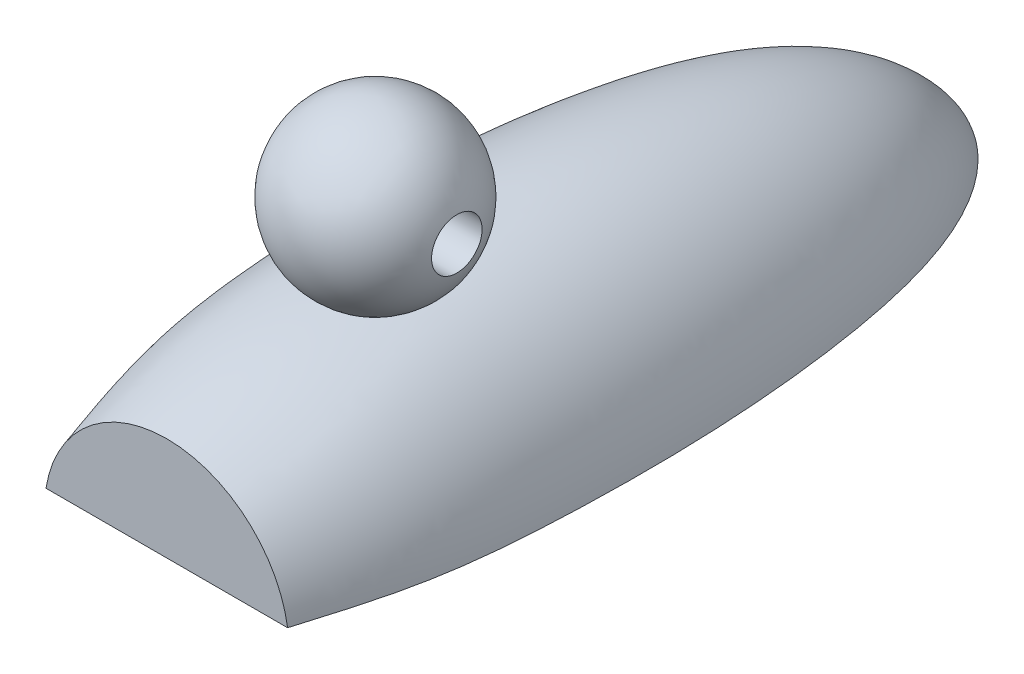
ISO-10303-21;
HEADER;
FILE_DESCRIPTION(('STEP AP214'),'2;1');
FILE_NAME('part.step','',(''),(''),'','','');
FILE_SCHEMA(('AUTOMOTIVE_DESIGN { 1 0 10303 214 1 1 1 1 }'));
ENDSEC;
DATA;
#1=APPLICATION_CONTEXT('core data for automotive mechanical design processes');
#2=APPLICATION_PROTOCOL_DEFINITION('international standard','automotive_design',2000,#1);
#3=PRODUCT_CONTEXT('',#1,'mechanical');
#4=PRODUCT('Part','Part','',(#3));
#5=PRODUCT_RELATED_PRODUCT_CATEGORY('part','',(#4));
#6=PRODUCT_DEFINITION_FORMATION('','',#4);
#7=PRODUCT_DEFINITION_CONTEXT('part definition',#1,'design');
#8=PRODUCT_DEFINITION('design','',#6,#7);
#9=PRODUCT_DEFINITION_SHAPE('','',#8);
#10=(LENGTH_UNIT() NAMED_UNIT(*) SI_UNIT(.MILLI.,.METRE.));
#11=(NAMED_UNIT(*) PLANE_ANGLE_UNIT() SI_UNIT($,.RADIAN.));
#12=(NAMED_UNIT(*) SI_UNIT($,.STERADIAN.) SOLID_ANGLE_UNIT());
#13=UNCERTAINTY_MEASURE_WITH_UNIT(LENGTH_MEASURE(1.E-05),#10,'distance_accuracy_value','');
#14=(GEOMETRIC_REPRESENTATION_CONTEXT(3) GLOBAL_UNCERTAINTY_ASSIGNED_CONTEXT((#13)) GLOBAL_UNIT_ASSIGNED_CONTEXT((#10,
#11,#12)) REPRESENTATION_CONTEXT('',''));
#15=CARTESIAN_POINT('',(0.,0.,0.));
#16=DIRECTION('',(0.,0.,1.));
#17=DIRECTION('',(1.,0.,0.));
#18=AXIS2_PLACEMENT_3D('',#15,#16,#17);
#19=CARTESIAN_POINT('',(0.,0.,0.));
#20=DIRECTION('',(1.,0.,0.));
#21=DIRECTION('',(0.,1.,0.));
#22=AXIS2_PLACEMENT_3D('',#19,#20,#21);
#23=SPHERICAL_SURFACE('',#22,27.);
#24=CARTESIAN_POINT('',(25.7875939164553,0.,0.));
#25=DIRECTION('',(1.,0.,0.));
#26=DIRECTION('',(0.,0.,-1.));
#27=AXIS2_PLACEMENT_3D('',#24,#25,#26);
#28=CIRCLE('',#27,7.99999999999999);
#29=CARTESIAN_POINT('',(25.7875939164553,0.,-7.99999999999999));
#30=VERTEX_POINT('',#29);
#31=EDGE_CURVE('E66',#30,#30,#28,.T.);
#32=ORIENTED_EDGE('',*,*,#31,.F.);
#33=EDGE_LOOP('',(#32));
#34=FACE_BOUND('',#33,.T.);
#35=CARTESIAN_POINT('',(-25.7875939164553,0.,0.));
#36=DIRECTION('',(1.,0.,0.));
#37=DIRECTION('',(0.,0.,-1.));
#38=AXIS2_PLACEMENT_3D('',#35,#36,#37);
#39=CIRCLE('',#38,7.99999999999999);
#40=CARTESIAN_POINT('',(-25.7875939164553,0.,-7.99999999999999));
#41=VERTEX_POINT('',#40);
#42=EDGE_CURVE('E47',#41,#41,#39,.T.);
#43=ORIENTED_EDGE('',*,*,#42,.T.);
#44=EDGE_LOOP('',(#43));
#45=FACE_BOUND('',#44,.T.);
#46=CARTESIAN_POINT('',(0.,-21.9206872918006,15.7633584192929));
#47=CARTESIAN_POINT('',(0.4049198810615,-21.9206851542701,15.7633657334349));
#48=CARTESIAN_POINT('',(0.809773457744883,-21.923426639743,15.7439388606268));
#49=CARTESIAN_POINT('',(1.61587280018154,-21.9342692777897,15.6665490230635));
#50=CARTESIAN_POINT('',(2.01711729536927,-21.9423722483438,15.6085729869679));
#51=CARTESIAN_POINT('',(2.81269208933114,-21.9636047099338,15.4548802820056));
#52=CARTESIAN_POINT('',(3.20701270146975,-21.9767407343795,15.3591145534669));
#53=CARTESIAN_POINT('',(3.98480005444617,-22.007477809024,15.1313158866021));
#54=CARTESIAN_POINT('',(4.36826763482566,-22.0250785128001,14.9992857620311));
#55=CARTESIAN_POINT('',(5.11961105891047,-22.0639285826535,14.7015494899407));
#56=CARTESIAN_POINT('',(5.48755092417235,-22.0851606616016,14.5360022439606));
#57=CARTESIAN_POINT('',(6.20715963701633,-22.1304924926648,14.173051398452));
#58=CARTESIAN_POINT('',(6.55882807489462,-22.1545923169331,13.9756469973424));
#59=CARTESIAN_POINT('',(7.24368372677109,-22.2047419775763,13.5514329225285));
#60=CARTESIAN_POINT('',(7.57687422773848,-22.2307914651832,13.3246285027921));
#61=CARTESIAN_POINT('',(8.22311891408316,-22.2838981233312,12.8441052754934));
#62=CARTESIAN_POINT('',(8.53617325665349,-22.3109552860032,12.5903866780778));
#63=CARTESIAN_POINT('',(9.13346844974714,-22.3644755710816,12.0650333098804));
#64=CARTESIAN_POINT('',(9.41822381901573,-22.3909371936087,11.7939819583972));
#65=CARTESIAN_POINT('',(9.96644842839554,-22.4430804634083,11.2309033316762));
#66=CARTESIAN_POINT('',(10.2299094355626,-22.4687618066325,10.9388680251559));
#67=CARTESIAN_POINT('',(10.7346796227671,-22.518523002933,10.3362397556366));
#68=CARTESIAN_POINT('',(10.9759931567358,-22.542603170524,10.0256504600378));
#69=CARTESIAN_POINT('',(11.4360597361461,-22.5884233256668,9.38801309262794));
#70=CARTESIAN_POINT('',(11.6548104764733,-22.6101630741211,9.06096334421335));
#71=CARTESIAN_POINT('',(12.0987557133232,-22.6534841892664,8.34516852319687));
#72=CARTESIAN_POINT('',(12.3204823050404,-22.6746078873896,7.95424173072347));
#73=CARTESIAN_POINT('',(12.7338070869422,-22.7120235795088,7.1565579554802));
#74=CARTESIAN_POINT('',(12.925403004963,-22.7283152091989,6.74979978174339));
#75=CARTESIAN_POINT('',(13.2784146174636,-22.7553113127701,5.92299235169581));
#76=CARTESIAN_POINT('',(13.4398155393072,-22.7660130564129,5.50293670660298));
#77=CARTESIAN_POINT('',(13.7322976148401,-22.7811902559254,4.65228545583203));
#78=CARTESIAN_POINT('',(13.8633765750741,-22.7856652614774,4.2216890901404));
#79=CARTESIAN_POINT('',(14.1099237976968,-22.7880333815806,3.29733297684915));
#80=CARTESIAN_POINT('',(14.2213136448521,-22.7850213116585,2.80247930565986));
#81=CARTESIAN_POINT('',(14.4057243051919,-22.7699614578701,1.80580053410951));
#82=CARTESIAN_POINT('',(14.4787421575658,-22.757912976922,1.30397489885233));
#83=CARTESIAN_POINT('',(14.5865211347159,-22.724493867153,0.296380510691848));
#84=CARTESIAN_POINT('',(14.6212700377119,-22.7031202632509,-0.209389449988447));
#85=CARTESIAN_POINT('',(14.6525566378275,-22.6509894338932,-1.22162604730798));
#86=CARTESIAN_POINT('',(14.649093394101,-22.6202319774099,-1.72809270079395));
#87=CARTESIAN_POINT('',(14.6023021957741,-22.5468120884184,-2.7769548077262));
#88=CARTESIAN_POINT('',(14.5559771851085,-22.503424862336,-3.31916865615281));
#89=CARTESIAN_POINT('',(14.4192003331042,-22.4064629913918,-4.39711676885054));
#90=CARTESIAN_POINT('',(14.3287456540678,-22.3528876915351,-4.93285061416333));
#91=CARTESIAN_POINT('',(14.1036456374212,-22.2363251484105,-5.9942360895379));
#92=CARTESIAN_POINT('',(13.9689766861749,-22.1733328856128,-6.5198821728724));
#93=CARTESIAN_POINT('',(13.6554655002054,-22.0390912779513,-7.55675604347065));
#94=CARTESIAN_POINT('',(13.4766249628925,-21.9678422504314,-8.06798438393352));
#95=CARTESIAN_POINT('',(13.0760372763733,-21.8190097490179,-9.06875192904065));
#96=CARTESIAN_POINT('',(12.8545584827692,-21.7414675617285,-9.55840440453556));
#97=CARTESIAN_POINT('',(12.3681905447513,-21.5814569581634,-10.5148898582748));
#98=CARTESIAN_POINT('',(12.1032978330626,-21.4989881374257,-10.9817209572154));
#99=CARTESIAN_POINT('',(11.5308094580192,-21.331365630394,-11.8872486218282));
#100=CARTESIAN_POINT('',(11.223269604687,-21.2462155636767,-12.3259808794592));
#101=CARTESIAN_POINT('',(10.7305627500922,-21.1183685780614,-12.9592808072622));
#102=CARTESIAN_POINT('',(10.5611076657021,-21.0757356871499,-13.1662336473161));
#103=CARTESIAN_POINT('',(10.2117936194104,-20.9907479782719,-13.5713340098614));
#104=CARTESIAN_POINT('',(10.0319320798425,-20.9483932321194,-13.7694793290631));
#105=CARTESIAN_POINT('',(9.56985069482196,-20.8433822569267,-14.2525798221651));
#106=CARTESIAN_POINT('',(9.28128145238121,-20.7811253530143,-14.5315986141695));
#107=CARTESIAN_POINT('',(8.68229637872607,-20.6593545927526,-15.0656393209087));
#108=CARTESIAN_POINT('',(8.37188507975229,-20.5998401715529,-15.3206661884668));
#109=CARTESIAN_POINT('',(7.73050622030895,-20.4848744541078,-15.8042308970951));
#110=CARTESIAN_POINT('',(7.39954653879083,-20.429421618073,-16.0327787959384));
#111=CARTESIAN_POINT('',(6.71859146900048,-20.3238798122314,-16.4610144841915));
#112=CARTESIAN_POINT('',(6.36859545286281,-20.273791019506,-16.6607013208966));
#113=CARTESIAN_POINT('',(5.6495237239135,-20.1799926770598,-17.0298938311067));
#114=CARTESIAN_POINT('',(5.28034761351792,-20.1363225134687,-17.1992144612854));
#115=CARTESIAN_POINT('',(4.52739786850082,-20.0569337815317,-17.5039594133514));
#116=CARTESIAN_POINT('',(4.14362409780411,-20.0212152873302,-17.6393834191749));
#117=CARTESIAN_POINT('',(3.36467375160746,-19.958798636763,-17.8743315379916));
#118=CARTESIAN_POINT('',(2.96950185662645,-19.9320968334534,-17.9738701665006));
#119=CARTESIAN_POINT('',(2.17106321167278,-19.8885233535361,-18.1355856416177));
#120=CARTESIAN_POINT('',(1.76779735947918,-19.8716505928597,-18.1977666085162));
#121=CARTESIAN_POINT('',(0.999295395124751,-19.8494895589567,-18.2792950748));
#122=CARTESIAN_POINT('',(0.634486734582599,-19.8431753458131,-18.3024382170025));
#123=CARTESIAN_POINT('',(-0.0958118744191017,-19.8390181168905,-18.3176840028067));
#124=CARTESIAN_POINT('',(-0.461301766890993,-19.8411744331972,-18.3097890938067));
#125=CARTESIAN_POINT('',(-1.19005461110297,-19.853900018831,-18.2630708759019));
#126=CARTESIAN_POINT('',(-1.55331808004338,-19.8644672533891,-18.2242550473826));
#127=CARTESIAN_POINT('',(-2.27495578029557,-19.8937382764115,-18.1162101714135));
#128=CARTESIAN_POINT('',(-2.63333001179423,-19.9124420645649,-18.0469811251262));
#129=CARTESIAN_POINT('',(-3.32918568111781,-19.9566599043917,-17.8821616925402));
#130=CARTESIAN_POINT('',(-3.66694521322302,-19.9818903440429,-17.7876646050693));
#131=CARTESIAN_POINT('',(-4.3333898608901,-20.0388709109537,-17.5723878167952));
#132=CARTESIAN_POINT('',(-4.66207531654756,-20.0706207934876,-17.451609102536));
#133=CARTESIAN_POINT('',(-5.30851399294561,-20.1399532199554,-17.1850345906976));
#134=CARTESIAN_POINT('',(-5.6262663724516,-20.1775362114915,-17.0392368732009));
#135=CARTESIAN_POINT('',(-6.24918418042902,-20.2577573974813,-16.7240672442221));
#136=CARTESIAN_POINT('',(-6.55434903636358,-20.3003958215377,-16.5546942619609));
#137=CARTESIAN_POINT('',(-7.16854011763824,-20.3925736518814,-16.1831277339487));
#138=CARTESIAN_POINT('',(-7.47670611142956,-20.4423732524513,-15.979577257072));
#139=CARTESIAN_POINT('',(-8.07599306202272,-20.5456942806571,-15.5496451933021));
#140=CARTESIAN_POINT('',(-8.36711350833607,-20.5992158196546,-15.3232629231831));
#141=CARTESIAN_POINT('',(-8.93132670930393,-20.7089713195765,-14.849533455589));
#142=CARTESIAN_POINT('',(-9.20441471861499,-20.7652059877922,-14.6021807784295));
#143=CARTESIAN_POINT('',(-9.73169712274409,-20.8793795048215,-14.0884477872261));
#144=CARTESIAN_POINT('',(-9.98588947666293,-20.937318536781,-13.8220654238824));
#145=CARTESIAN_POINT('',(-10.5052302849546,-21.0612072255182,-13.2378679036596));
#146=CARTESIAN_POINT('',(-10.7677997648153,-21.1272557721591,-12.9177792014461));
#147=CARTESIAN_POINT('',(-11.2676942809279,-21.259021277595,-12.2584103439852));
#148=CARTESIAN_POINT('',(-11.5050175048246,-21.3247382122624,-11.9191288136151));
#149=CARTESIAN_POINT('',(-11.9541502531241,-21.4546943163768,-11.223636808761));
#150=CARTESIAN_POINT('',(-12.1659497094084,-21.5189328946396,-10.8674197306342));
#151=CARTESIAN_POINT('',(-12.5637125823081,-21.6448745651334,-10.1404247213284));
#152=CARTESIAN_POINT('',(-12.7496748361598,-21.7065775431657,-9.76964613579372));
#153=CARTESIAN_POINT('',(-13.1206241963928,-21.8352223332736,-8.96115590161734));
#154=CARTESIAN_POINT('',(-13.3015914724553,-21.90163370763,-8.52151142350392));
#155=CARTESIAN_POINT('',(-13.6294267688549,-22.028819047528,-7.62889343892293));
#156=CARTESIAN_POINT('',(-13.7762919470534,-22.0895925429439,-7.17591882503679));
#157=CARTESIAN_POINT('',(-14.0359447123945,-22.2045869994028,-6.25930170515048));
#158=CARTESIAN_POINT('',(-14.1487185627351,-22.258805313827,-5.7956549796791));
#159=CARTESIAN_POINT('',(-14.3401119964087,-22.3599247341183,-4.8605855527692));
#160=CARTESIAN_POINT('',(-14.4187303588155,-22.4068255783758,-4.38916257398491));
#161=CARTESIAN_POINT('',(-14.548473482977,-22.4974175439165,-3.38983093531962));
#162=CARTESIAN_POINT('',(-14.5957015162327,-22.5402118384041,-2.86133113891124));
#163=CARTESIAN_POINT('',(-14.6481747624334,-22.6156694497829,-1.80150976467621));
#164=CARTESIAN_POINT('',(-14.6534169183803,-22.6483320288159,-1.27018798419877));
#165=CARTESIAN_POINT('',(-14.6218420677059,-22.7033379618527,-0.208067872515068));
#166=CARTESIAN_POINT('',(-14.5850106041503,-22.7256777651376,0.322730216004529));
#167=CARTESIAN_POINT('',(-14.4691642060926,-22.7600945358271,1.38004524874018));
#168=CARTESIAN_POINT('',(-14.3901491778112,-22.7721714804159,1.90656218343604));
#169=CARTESIAN_POINT('',(-14.1864515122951,-22.7866399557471,2.96918497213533));
#170=CARTESIAN_POINT('',(-14.0603261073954,-22.7886930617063,3.50502016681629));
#171=CARTESIAN_POINT('',(-13.7627633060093,-22.782869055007,4.56395881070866));
#172=CARTESIAN_POINT('',(-13.5913237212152,-22.7749914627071,5.08706164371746));
#173=CARTESIAN_POINT('',(-13.2030907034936,-22.7502803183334,6.11601761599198));
#174=CARTESIAN_POINT('',(-12.986294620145,-22.733446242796,6.62186974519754));
#175=CARTESIAN_POINT('',(-12.5075041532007,-22.6920994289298,7.611401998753));
#176=CARTESIAN_POINT('',(-12.2455136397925,-22.6675873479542,8.09508401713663));
#177=CARTESIAN_POINT('',(-11.6930937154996,-22.6140431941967,9.00807386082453));
#178=CARTESIAN_POINT('',(-11.4051589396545,-22.5853512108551,9.43890916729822));
#179=CARTESIAN_POINT('',(-10.7902569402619,-22.5240954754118,10.2715280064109));
#180=CARTESIAN_POINT('',(-10.4632894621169,-22.4915316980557,10.673311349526));
#181=CARTESIAN_POINT('',(-9.77167081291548,-22.4242923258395,11.4426361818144));
#182=CARTESIAN_POINT('',(-9.4070422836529,-22.3896180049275,11.8101979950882));
#183=CARTESIAN_POINT('',(-8.83346187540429,-22.3374650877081,12.3318603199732));
#184=CARTESIAN_POINT('',(-8.63783495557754,-22.3200577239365,12.5007964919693));
#185=CARTESIAN_POINT('',(-8.23789337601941,-22.2854313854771,12.828240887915));
#186=CARTESIAN_POINT('',(-8.03357556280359,-22.2682124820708,12.9867452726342));
#187=CARTESIAN_POINT('',(-7.4643914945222,-22.2218024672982,13.4043012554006));
#188=CARTESIAN_POINT('',(-7.0912463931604,-22.1930514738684,13.652246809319));
#189=CARTESIAN_POINT('',(-6.32270997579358,-22.1381855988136,14.1111678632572));
#190=CARTESIAN_POINT('',(-5.92732331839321,-22.112070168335,14.3221510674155));
#191=CARTESIAN_POINT('',(-5.32039208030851,-22.0758217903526,14.6082724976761));
#192=CARTESIAN_POINT('',(-5.11595442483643,-22.0642351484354,14.6985229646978));
#193=CARTESIAN_POINT('',(-4.7028164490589,-22.0421642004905,14.8686425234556));
#194=CARTESIAN_POINT('',(-4.49411738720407,-22.0316795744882,14.948514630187));
#195=CARTESIAN_POINT('',(-3.86240924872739,-22.0020823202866,15.1720110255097));
#196=CARTESIAN_POINT('',(-3.43352647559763,-21.9848103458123,15.2996396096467));
#197=CARTESIAN_POINT('',(-2.50882046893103,-21.9542353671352,15.5232752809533));
#198=CARTESIAN_POINT('',(-2.01147423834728,-21.9417269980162,15.6131159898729));
#199=CARTESIAN_POINT('',(-1.00938468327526,-21.9249540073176,15.7331550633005));
#200=CARTESIAN_POINT('',(-0.50464084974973,-21.9206899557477,15.7633493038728));
#201=CARTESIAN_POINT('',(0.,-21.9206872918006,15.7633584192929));
#202=B_SPLINE_CURVE_WITH_KNOTS('',3,(#46,#47,#48,#49,#50,#51,#52,#53,#54,#55,#56,#57,#58,#59,
#60,#61,#62,#63,#64,#65,#66,#67,#68,#69,#70,#71,#72,#73,#74,#75,#76,#77,#78,#79,#80,#81,#82,#83,
#84,#85,#86,#87,#88,#89,#90,#91,#92,#93,#94,#95,#96,#97,#98,#99,#100,#101,#102,#103,#104,#105,
#106,#107,#108,#109,#110,#111,#112,#113,#114,#115,#116,#117,#118,#119,#120,#121,#122,#123,#124,
#125,#126,#127,#128,#129,#130,#131,#132,#133,#134,#135,#136,#137,#138,#139,#140,#141,#142,#143,
#144,#145,#146,#147,#148,#149,#150,#151,#152,#153,#154,#155,#156,#157,#158,#159,#160,#161,#162,
#163,#164,#165,#166,#167,#168,#169,#170,#171,#172,#173,#174,#175,#176,#177,#178,#179,#180,#181,
#182,#183,#184,#185,#186,#187,#188,#189,#190,#191,#192,#193,#194,#195,#196,#197,#198,#199,#200,
#201),.UNSPECIFIED.,.T.,.F.,(4,2,2,2,2,2,2,2,2,2,2,2,2,2,2,2,2,2,2,2,2,2,2,2,2,2,2,2,2,2,2,2,2,
2,2,2,2,2,2,2,2,2,2,2,2,2,2,2,2,2,2,2,2,2,2,2,2,2,2,2,2,2,2,2,2,2,2,2,2,2,2,2,2,2,2,2,2,4),(0.,
1.21417348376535,2.42875888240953,3.64492630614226,4.86099939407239,6.07143679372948,
7.28190465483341,8.49215649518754,9.70239888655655,10.883302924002,12.0646613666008,
13.2457870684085,14.4270333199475,15.7754219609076,17.1239122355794,18.4730605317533,
19.8223063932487,21.3424006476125,22.8626121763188,24.3833090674,25.9040434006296,
27.5398642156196,29.1757902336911,30.8125913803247,32.4493296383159,34.0760848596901,
35.7029738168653,37.3277534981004,38.1400259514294,38.9525004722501,40.1697846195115,
41.3868169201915,42.6033854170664,43.8199940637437,45.0437815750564,46.2675804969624,
47.4908838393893,48.7140522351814,49.8094578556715,50.9047771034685,51.9998314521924,
53.0948857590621,54.1486190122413,55.2023127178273,56.2560873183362,57.3099097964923,
58.4267463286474,59.5436162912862,60.6607790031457,61.77806220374,63.0345104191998,
64.2910487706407,65.5480811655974,66.8051701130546,68.2438161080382,69.6825819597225,
71.1219267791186,72.561323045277,74.1565110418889,75.751815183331,77.3476676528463,
78.9435236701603,80.5929032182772,82.2423624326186,83.8919180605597,85.5413325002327,
87.0960974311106,88.6508725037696,90.2047182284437,90.9815953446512,91.7587567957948,
93.1034747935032,94.4479121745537,95.1189804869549,95.7898534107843,97.1307301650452,
98.6438175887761,100.157009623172),.UNSPECIFIED.);
#203=CARTESIAN_POINT('',(0.,-21.9206872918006,15.7633584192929));
#204=VERTEX_POINT('',#203);
#205=EDGE_CURVE('E63',#204,#204,#202,.T.);
#206=ORIENTED_EDGE('',*,*,#205,.T.);
#207=EDGE_LOOP('',(#206));
#208=FACE_BOUND('',#207,.T.);
#209=ADVANCED_FACE('F34',(#34,#45,#208),#23,.T.);
#210=CARTESIAN_POINT('',(36.8111492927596,0.,0.));
#211=DIRECTION('',(1.,0.,0.));
#212=DIRECTION('',(0.,0.,-1.));
#213=AXIS2_PLACEMENT_3D('',#210,#211,#212);
#214=CYLINDRICAL_SURFACE('',#213,7.99999999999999);
#215=ORIENTED_EDGE('',*,*,#31,.T.);
#216=EDGE_LOOP('',(#215));
#217=FACE_BOUND('',#216,.T.);
#218=ORIENTED_EDGE('',*,*,#42,.F.);
#219=EDGE_LOOP('',(#218));
#220=FACE_BOUND('',#219,.T.);
#221=ADVANCED_FACE('F81',(#217,#220),#214,.F.);
#222=CARTESIAN_POINT('',(0.,-72.,66.));
#223=DIRECTION('',(0.,0.,-1.));
#224=DIRECTION('',(-1.,0.,0.));
#225=AXIS2_PLACEMENT_3D('',#222,#223,#224);
#226=PLANE('',#225);
#227=CARTESIAN_POINT('',(0.,-72.,66.));
#228=DIRECTION('',(0.,0.,1.));
#229=DIRECTION('',(1.,0.,0.));
#230=AXIS2_PLACEMENT_3D('',#227,#228,#229);
#231=CIRCLE('',#230,38.6990161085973);
#232=CARTESIAN_POINT('',(38.2310586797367,-66.,66.));
#233=VERTEX_POINT('',#232);
#234=CARTESIAN_POINT('',(-38.2310586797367,-66.,66.));
#235=VERTEX_POINT('',#234);
#236=EDGE_CURVE('E60',#233,#235,#231,.T.);
#237=ORIENTED_EDGE('',*,*,#236,.T.);
#238=DIRECTION('',(-1.,0.,0.));
#239=VECTOR('',#238,1.);
#240=CARTESIAN_POINT('',(-100.,-66.,66.));
#241=LINE('',#240,#239);
#242=EDGE_CURVE('E53',#233,#235,#241,.T.);
#243=ORIENTED_EDGE('',*,*,#242,.F.);
#244=EDGE_LOOP('',(#237,#243));
#245=FACE_BOUND('',#244,.T.);
#246=ADVANCED_FACE('F59',(#245),#226,.F.);
#247=CARTESIAN_POINT('',(0.,-72.,-186.));
#248=CARTESIAN_POINT('',(4.78199922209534,-72.,-183.29044534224));
#249=CARTESIAN_POINT('',(29.4663279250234,-72.0000000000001,-169.303923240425));
#250=CARTESIAN_POINT('',(41.9511666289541,-72.0000000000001,-133.547416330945));
#251=CARTESIAN_POINT('',(51.8461961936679,-72.0000000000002,-76.9265745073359));
#252=CARTESIAN_POINT('',(53.5471873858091,-72.0000000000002,-26.4636558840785));
#253=CARTESIAN_POINT('',(49.5128183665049,-72.0000000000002,29.7935446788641));
#254=CARTESIAN_POINT('',(42.00322583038,-72.0000000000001,54.9369419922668));
#255=CARTESIAN_POINT('',(38.6990161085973,-72.0000000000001,66.));
#256=B_SPLINE_CURVE_WITH_KNOTS('',3,(#247,#248,#249,#250,#251,#252,#253,#254,#255),
.UNSPECIFIED.,.F.,.F.,(4,1,1,1,1,1,4),(0.,0.0608080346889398,0.313886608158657,
0.373047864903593,0.707904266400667,0.871478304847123,1.),.UNSPECIFIED.);
#257=CARTESIAN_POINT('',(0.,-72.,66.));
#258=DIRECTION('',(0.,0.,1.));
#259=AXIS1_PLACEMENT('',#257,#258);
#260=SURFACE_OF_REVOLUTION('',#256,#259);
#261=ORIENTED_EDGE('',*,*,#205,.F.);
#262=EDGE_LOOP('',(#261));
#263=FACE_BOUND('',#262,.T.);
#264=ORIENTED_EDGE('',*,*,#236,.F.);
#265=CARTESIAN_POINT('',(38.2310586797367,-66.,66.));
#266=CARTESIAN_POINT('',(38.8930355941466,-66.,63.810325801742));
#267=CARTESIAN_POINT('',(39.5546955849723,-66.,61.6204427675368));
#268=CARTESIAN_POINT('',(40.8595463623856,-66.,57.239671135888));
#269=CARTESIAN_POINT('',(41.5027694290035,-66.,55.0487921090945));
#270=CARTESIAN_POINT('',(42.7541782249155,-66.,50.6619595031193));
#271=CARTESIAN_POINT('',(43.3624358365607,-66.,48.4660267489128));
#272=CARTESIAN_POINT('',(44.1393879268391,-66.,45.5307113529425));
#273=CARTESIAN_POINT('',(44.3305362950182,-66.,44.7972614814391));
#274=CARTESIAN_POINT('',(44.7066127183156,-66.,43.3287647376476));
#275=CARTESIAN_POINT('',(44.8915407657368,-66.,42.5937178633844));
#276=CARTESIAN_POINT('',(45.2545383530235,-66.,41.1219258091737));
#277=CARTESIAN_POINT('',(45.4326078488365,-66.,40.38518061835));
#278=CARTESIAN_POINT('',(45.7809950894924,-66.,38.9109713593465));
#279=CARTESIAN_POINT('',(45.9513235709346,-66.,38.1735098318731));
#280=CARTESIAN_POINT('',(46.283848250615,-66.,36.6967558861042));
#281=CARTESIAN_POINT('',(46.4460444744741,-66.,35.9574634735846));
#282=CARTESIAN_POINT('',(46.7616755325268,-66.,34.477017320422));
#283=CARTESIAN_POINT('',(46.9151104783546,-66.,33.735863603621));
#284=CARTESIAN_POINT('',(47.2124531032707,-66.,32.2518488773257));
#285=CARTESIAN_POINT('',(47.3563632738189,-66.,31.5089883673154));
#286=CARTESIAN_POINT('',(47.6348964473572,-66.,30.0215200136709));
#287=CARTESIAN_POINT('',(47.769519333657,-66.,29.2769121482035));
#288=CARTESIAN_POINT('',(48.0298510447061,-66.,27.7861409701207));
#289=CARTESIAN_POINT('',(48.1555598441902,-66.,27.0399776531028));
#290=CARTESIAN_POINT('',(48.4585576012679,-66.,25.1762188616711));
#291=CARTESIAN_POINT('',(48.6305442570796,-66.,24.0577578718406));
#292=CARTESIAN_POINT('',(48.9565076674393,-66.,21.8182356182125));
#293=CARTESIAN_POINT('',(49.1104844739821,-66.,20.6971743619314));
#294=CARTESIAN_POINT('',(49.5472635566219,-66.,17.3301050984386));
#295=CARTESIAN_POINT('',(49.8048209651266,-66.,15.0807949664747));
#296=CARTESIAN_POINT('',(50.2623495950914,-66.,10.5749792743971));
#297=CARTESIAN_POINT('',(50.4622836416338,-66.,8.31847001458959));
#298=CARTESIAN_POINT('',(50.7260978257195,-66.,4.93021270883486));
#299=CARTESIAN_POINT('',(50.8080429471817,-66.,3.79982958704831));
#300=CARTESIAN_POINT('',(50.9610645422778,-66.,1.53832608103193));
#301=CARTESIAN_POINT('',(51.0321410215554,-66.,0.407205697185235));
#302=CARTESIAN_POINT('',(51.164640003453,-66.,-1.85605617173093));
#303=CARTESIAN_POINT('',(51.2260585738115,-66.,-2.98819788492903));
#304=CARTESIAN_POINT('',(51.3403932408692,-66.,-5.25290920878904));
#305=CARTESIAN_POINT('',(51.3933093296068,-66.,-6.38547881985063));
#306=CARTESIAN_POINT('',(51.4917990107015,-66.,-8.65087046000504));
#307=CARTESIAN_POINT('',(51.5373730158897,-66.,-9.78369247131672));
#308=CARTESIAN_POINT('',(51.6223982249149,-66.,-12.0495651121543));
#309=CARTESIAN_POINT('',(51.6618494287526,-66.,-13.1826157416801));
#310=CARTESIAN_POINT('',(51.7361717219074,-66.,-15.4994679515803));
#311=CARTESIAN_POINT('',(51.7707599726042,-66.,-16.6832786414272));
#312=CARTESIAN_POINT('',(51.8329937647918,-66.,-19.0510816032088));
#313=CARTESIAN_POINT('',(51.8606393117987,-66.,-20.2350738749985));
#314=CARTESIAN_POINT('',(51.9088212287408,-66.,-22.6026976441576));
#315=CARTESIAN_POINT('',(51.92936063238,-66.,-23.7863290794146));
#316=CARTESIAN_POINT('',(51.9631826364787,-66.,-26.1536944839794));
#317=CARTESIAN_POINT('',(51.9764652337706,-66.,-27.3374284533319));
#318=CARTESIAN_POINT('',(52.0051753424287,-66.,-30.8879549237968));
#319=CARTESIAN_POINT('',(52.0094811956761,-66.,-33.2548489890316));
#320=CARTESIAN_POINT('',(51.9870863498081,-66.,-37.9880209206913));
#321=CARTESIAN_POINT('',(51.960391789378,-66.,-40.3542988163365));
#322=CARTESIAN_POINT('',(51.874627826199,-66.,-45.086157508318));
#323=CARTESIAN_POINT('',(51.8155600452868,-66.,-47.4517383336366));
#324=CARTESIAN_POINT('',(51.6636247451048,-66.,-52.1821108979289));
#325=CARTESIAN_POINT('',(51.5707530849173,-66.,-54.546902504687));
#326=CARTESIAN_POINT('',(51.3493213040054,-66.,-59.2841836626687));
#327=CARTESIAN_POINT('',(51.2206216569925,-66.,-61.6566667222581));
#328=CARTESIAN_POINT('',(50.9261624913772,-66.,-66.3997072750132));
#329=CARTESIAN_POINT('',(50.7603972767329,-66.,-68.7702644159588));
#330=CARTESIAN_POINT('',(50.3902707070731,-66.,-73.5084641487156));
#331=CARTESIAN_POINT('',(50.1859078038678,-66.,-75.876106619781));
#332=CARTESIAN_POINT('',(49.7370252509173,-66.,-80.6075095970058));
#333=CARTESIAN_POINT('',(49.4925072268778,-66.,-82.9712702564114));
#334=CARTESIAN_POINT('',(49.0944238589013,-66.,-86.5132690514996));
#335=CARTESIAN_POINT('',(48.9565174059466,-66.,-87.6932843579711));
#336=CARTESIAN_POINT('',(48.6700636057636,-66.,-90.0520240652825));
#337=CARTESIAN_POINT('',(48.5215162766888,-66.,-91.2307484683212));
#338=CARTESIAN_POINT('',(48.2135911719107,-66.,-93.5866716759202));
#339=CARTESIAN_POINT('',(48.0542144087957,-66.,-94.7638706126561));
#340=CARTESIAN_POINT('',(47.8068653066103,-66.,-96.5285073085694));
#341=CARTESIAN_POINT('',(47.7230346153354,-66.,-97.116528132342));
#342=CARTESIAN_POINT('',(47.5525838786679,-66.,-98.2921661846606));
#343=CARTESIAN_POINT('',(47.4659638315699,-66.,-98.8797834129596));
#344=CARTESIAN_POINT('',(47.2817415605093,-66.,-100.109159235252));
#345=CARTESIAN_POINT('',(47.1838665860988,-66.,-100.750876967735));
#346=CARTESIAN_POINT('',(46.9846910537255,-66.,-102.033780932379));
#347=CARTESIAN_POINT('',(46.883390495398,-66.,-102.674967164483));
#348=CARTESIAN_POINT('',(46.677064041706,-66.,-103.956739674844));
#349=CARTESIAN_POINT('',(46.5720381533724,-66.,-104.597325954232));
#350=CARTESIAN_POINT('',(46.3580032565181,-66.,-105.877831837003));
#351=CARTESIAN_POINT('',(46.2489942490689,-66.,-106.517751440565));
#352=CARTESIAN_POINT('',(45.9156216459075,-66.,-108.436346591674));
#353=CARTESIAN_POINT('',(45.6849017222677,-66.,-109.713925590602));
#354=CARTESIAN_POINT('',(45.2047264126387,-66.,-112.265570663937));
#355=CARTESIAN_POINT('',(44.9552710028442,-66.,-113.539636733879));
#356=CARTESIAN_POINT('',(44.565914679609,-66.,-115.447879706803));
#357=CARTESIAN_POINT('',(44.4335738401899,-66.,-116.083604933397));
#358=CARTESIAN_POINT('',(44.1637026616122,-66.,-117.353952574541));
#359=CARTESIAN_POINT('',(44.0261723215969,-66.,-117.988574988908));
#360=CARTESIAN_POINT('',(43.6054201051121,-66.,-119.890642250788));
#361=CARTESIAN_POINT('',(43.3140353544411,-66.,-121.15629537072));
#362=CARTESIAN_POINT('',(42.7089347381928,-66.,-123.675703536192));
#363=CARTESIAN_POINT('',(42.3953352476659,-66.,-124.929486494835));
#364=CARTESIAN_POINT('',(41.7424239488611,-66.,-127.430350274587));
#365=CARTESIAN_POINT('',(41.4031122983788,-66.,-128.677431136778));
#366=CARTESIAN_POINT('',(40.6966109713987,-66.,-131.163353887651));
#367=CARTESIAN_POINT('',(40.3294282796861,-66.,-132.402197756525));
#368=CARTESIAN_POINT('',(39.5647032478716,-66.,-134.870533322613));
#369=CARTESIAN_POINT('',(39.1671602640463,-66.,-136.100024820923));
#370=CARTESIAN_POINT('',(38.3394160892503,-66.,-138.547137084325));
#371=CARTESIAN_POINT('',(37.909235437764,-66.,-139.764764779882));
#372=CARTESIAN_POINT('',(37.0132918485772,-66.,-142.186799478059));
#373=CARTESIAN_POINT('',(36.547531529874,-66.,-143.391207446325));
#374=CARTESIAN_POINT('',(35.6297427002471,-66.,-145.655517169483));
#375=CARTESIAN_POINT('',(35.1816403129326,-66.,-146.717008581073));
#376=CARTESIAN_POINT('',(34.2525839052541,-66.,-148.825516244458));
#377=CARTESIAN_POINT('',(33.7716308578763,-66.,-149.872532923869));
#378=CARTESIAN_POINT('',(32.7745523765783,-66.,-151.949786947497));
#379=CARTESIAN_POINT('',(32.2584251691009,-66.,-152.980023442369));
#380=CARTESIAN_POINT('',(31.1871792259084,-66.,-155.023710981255));
#381=CARTESIAN_POINT('',(30.6319564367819,-66.,-156.037107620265));
#382=CARTESIAN_POINT('',(29.4813887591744,-66.,-158.040911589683));
#383=CARTESIAN_POINT('',(28.8860441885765,-66.,-159.031319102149));
#384=CARTESIAN_POINT('',(27.6528677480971,-66.,-160.985348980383));
#385=CARTESIAN_POINT('',(27.0150371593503,-66.,-161.948972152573));
#386=CARTESIAN_POINT('',(25.6851313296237,-66.,-163.858723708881));
#387=CARTESIAN_POINT('',(24.9924093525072,-66.,-164.804403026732));
#388=CARTESIAN_POINT('',(23.5586680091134,-66.,-166.658691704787));
#389=CARTESIAN_POINT('',(22.8176435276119,-66.,-167.567297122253));
#390=CARTESIAN_POINT('',(21.2852210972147,-66.,-169.341833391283));
#391=CARTESIAN_POINT('',(20.4937994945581,-66.,-170.207743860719));
#392=CARTESIAN_POINT('',(18.864229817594,-66.,-171.884904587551));
#393=CARTESIAN_POINT('',(18.0263824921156,-66.,-172.696445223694));
#394=CARTESIAN_POINT('',(16.7311683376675,-66.,-173.870833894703));
#395=CARTESIAN_POINT('',(16.2930808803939,-66.,-174.255097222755));
#396=CARTESIAN_POINT('',(15.4038890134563,-66.,-175.00835009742));
#397=CARTESIAN_POINT('',(14.9527843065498,-66.,-175.377339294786));
#398=CARTESIAN_POINT('',(14.2666263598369,-66.,-175.918188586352));
#399=CARTESIAN_POINT('',(14.0364528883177,-66.,-176.096271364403));
#400=CARTESIAN_POINT('',(13.5728370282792,-66.,-176.448138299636));
#401=CARTESIAN_POINT('',(13.3393946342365,-66.,-176.621922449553));
#402=CARTESIAN_POINT('',(12.8692504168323,-66.,-176.964981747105));
#403=CARTESIAN_POINT('',(12.6325488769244,-66.,-177.134257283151));
#404=CARTESIAN_POINT('',(12.1558620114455,-66.,-177.468110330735));
#405=CARTESIAN_POINT('',(11.9158767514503,-66.,-177.632687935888));
#406=CARTESIAN_POINT('',(11.4512100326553,-66.,-177.944729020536));
#407=CARTESIAN_POINT('',(11.2267612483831,-66.,-178.092538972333));
#408=CARTESIAN_POINT('',(10.7752399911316,-66.,-178.384072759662));
#409=CARTESIAN_POINT('',(10.5481675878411,-66.,-178.527796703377));
#410=CARTESIAN_POINT('',(9.86307220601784,-66.,-178.952736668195));
#411=CARTESIAN_POINT('',(9.4011533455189,-66.,-179.227732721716));
#412=CARTESIAN_POINT('',(8.69955113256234,-66.,-179.62716384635));
#413=CARTESIAN_POINT('',(8.46371209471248,-66.,-179.758398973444));
#414=CARTESIAN_POINT('',(7.98936083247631,-66.,-180.015940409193));
#415=CARTESIAN_POINT('',(7.75084870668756,-66.,-180.142246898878));
#416=CARTESIAN_POINT('',(7.27106021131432,-66.,-180.389462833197));
#417=CARTESIAN_POINT('',(7.02978402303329,-66.,-180.510372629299));
#418=CARTESIAN_POINT('',(6.54430713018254,-66.,-180.746151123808));
#419=CARTESIAN_POINT('',(6.30010658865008,-66.,-180.86102015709));
#420=CARTESIAN_POINT('',(5.80617330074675,-66.,-181.084925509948));
#421=CARTESIAN_POINT('',(5.55640985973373,-66.,-181.193894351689));
#422=CARTESIAN_POINT('',(5.05341667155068,-66.,-181.403558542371));
#423=CARTESIAN_POINT('',(4.80018691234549,-66.,-181.504253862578));
#424=CARTESIAN_POINT('',(4.28988998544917,-66.,-181.695782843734));
#425=CARTESIAN_POINT('',(4.03282139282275,-66.,-181.78661273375));
#426=CARTESIAN_POINT('',(3.5166657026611,-66.,-181.955632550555));
#427=CARTESIAN_POINT('',(3.25760833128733,-66.,-182.033912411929));
#428=CARTESIAN_POINT('',(2.73562036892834,-66.,-182.176124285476));
#429=CARTESIAN_POINT('',(2.47269091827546,-66.,-182.240060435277));
#430=CARTESIAN_POINT('',(1.94331021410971,-66.,-182.350780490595));
#431=CARTESIAN_POINT('',(1.6768607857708,-66.,-182.39757294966));
#432=CARTESIAN_POINT('',(1.19731563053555,-66.,-182.463664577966));
#433=CARTESIAN_POINT('',(0.984730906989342,-66.,-182.486669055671));
#434=CARTESIAN_POINT('',(0.55850884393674,-66.,-182.519364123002));
#435=CARTESIAN_POINT('',(0.344871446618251,-66.,-182.529053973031));
#436=CARTESIAN_POINT('',(-0.082518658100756,-66.,-182.534665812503));
#437=CARTESIAN_POINT('',(-0.296271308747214,-66.,-182.530592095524));
#438=CARTESIAN_POINT('',(-0.723671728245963,-66.,-182.508847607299));
#439=CARTESIAN_POINT('',(-0.937317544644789,-66.,-182.491138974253));
#440=CARTESIAN_POINT('',(-1.3631973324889,-66.,-182.442858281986));
#441=CARTESIAN_POINT('',(-1.57543085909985,-66.,-182.412282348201));
#442=CARTESIAN_POINT('',(-1.99788809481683,-66.,-182.339462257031));
#443=CARTESIAN_POINT('',(-2.20811154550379,-66.,-182.297216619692));
#444=CARTESIAN_POINT('',(-2.674934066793,-66.,-182.191396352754));
#445=CARTESIAN_POINT('',(-2.93092373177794,-66.,-182.125145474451));
#446=CARTESIAN_POINT('',(-3.43920242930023,-66.,-181.979553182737));
#447=CARTESIAN_POINT('',(-3.69149007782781,-66.,-181.900207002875));
#448=CARTESIAN_POINT('',(-4.1925512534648,-66.,-181.730627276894));
#449=CARTESIAN_POINT('',(-4.44132215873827,-66.,-181.640386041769));
#450=CARTESIAN_POINT('',(-4.93540464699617,-66.,-181.450880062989));
#451=CARTESIAN_POINT('',(-5.18071594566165,-66.,-181.351614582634));
#452=CARTESIAN_POINT('',(-5.66961684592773,-66.,-181.144849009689));
#453=CARTESIAN_POINT('',(-5.9131864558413,-66.,-181.037301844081));
#454=CARTESIAN_POINT('',(-6.39714360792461,-66.,-180.815678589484));
#455=CARTESIAN_POINT('',(-6.63753303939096,-66.,-180.70160661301));
#456=CARTESIAN_POINT('',(-7.11543938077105,-66.,-180.467703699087));
#457=CARTESIAN_POINT('',(-7.3529567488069,-66.,-180.347873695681));
#458=CARTESIAN_POINT('',(-7.82532572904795,-66.,-180.103021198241));
#459=CARTESIAN_POINT('',(-8.0601770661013,-66.,-179.977998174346));
#460=CARTESIAN_POINT('',(-8.56741958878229,-66.,-179.701314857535));
#461=CARTESIAN_POINT('',(-8.83932755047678,-66.,-179.548768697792));
#462=CARTESIAN_POINT('',(-9.37967645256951,-66.,-179.23763690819));
#463=CARTESIAN_POINT('',(-9.64811724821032,-66.,-179.079051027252));
#464=CARTESIAN_POINT('',(-10.1816812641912,-66.,-178.756068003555));
#465=CARTESIAN_POINT('',(-10.4468025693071,-66.,-178.591667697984));
#466=CARTESIAN_POINT('',(-10.9735251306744,-66.,-178.257331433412));
#467=CARTESIAN_POINT('',(-11.2351264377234,-66.,-178.087395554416));
#468=CARTESIAN_POINT('',(-11.7548143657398,-66.,-177.742036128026));
#469=CARTESIAN_POINT('',(-12.0128997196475,-66.,-177.56661067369));
#470=CARTESIAN_POINT('',(-12.5253069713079,-66.,-177.210347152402));
#471=CARTESIAN_POINT('',(-12.7796288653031,-66.,-177.029509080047));
#472=CARTESIAN_POINT('',(-13.2844866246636,-66.,-176.662640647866));
#473=CARTESIAN_POINT('',(-13.5350226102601,-66.,-176.476610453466));
#474=CARTESIAN_POINT('',(-14.0323387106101,-66.,-176.099602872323));
#475=CARTESIAN_POINT('',(-14.279118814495,-66.,-175.908625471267));
#476=CARTESIAN_POINT('',(-15.0122502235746,-66.,-175.329847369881));
#477=CARTESIAN_POINT('',(-15.4930559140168,-66.,-174.934988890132));
#478=CARTESIAN_POINT('',(-16.439764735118,-66.,-174.128047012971));
#479=CARTESIAN_POINT('',(-16.9056710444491,-66.,-173.715967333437));
#480=CARTESIAN_POINT('',(-17.8228083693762,-66.,-172.875784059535));
#481=CARTESIAN_POINT('',(-18.2740393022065,-66.,-172.447680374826));
#482=CARTESIAN_POINT('',(-19.1619458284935,-66.,-171.576632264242));
#483=CARTESIAN_POINT('',(-19.5986205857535,-66.,-171.133686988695));
#484=CARTESIAN_POINT('',(-20.9280864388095,-66.,-169.741230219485));
#485=CARTESIAN_POINT('',(-21.7965422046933,-66.,-168.768315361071));
#486=CARTESIAN_POINT('',(-23.4724174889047,-66.,-166.770794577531));
#487=CARTESIAN_POINT('',(-24.2798064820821,-66.,-165.746163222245));
#488=CARTESIAN_POINT('',(-25.8359640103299,-66.,-163.653165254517));
#489=CARTESIAN_POINT('',(-26.5847230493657,-66.,-162.584791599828));
#490=CARTESIAN_POINT('',(-28.0289614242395,-66.,-160.407623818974));
#491=CARTESIAN_POINT('',(-28.7242550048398,-66.,-159.29870692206));
#492=CARTESIAN_POINT('',(-30.0620453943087,-66.,-157.049924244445));
#493=CARTESIAN_POINT('',(-30.7045544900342,-66.,-155.910065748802));
#494=CARTESIAN_POINT('',(-31.9404200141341,-66.,-153.60416989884));
#495=CARTESIAN_POINT('',(-32.5337793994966,-66.,-152.438134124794));
#496=CARTESIAN_POINT('',(-33.602159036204,-66.,-150.233967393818));
#497=CARTESIAN_POINT('',(-34.0826255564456,-66.,-149.198464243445));
#498=CARTESIAN_POINT('',(-35.0110662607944,-66.,-147.112936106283));
#499=CARTESIAN_POINT('',(-35.4590383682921,-66.,-146.062910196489));
#500=CARTESIAN_POINT('',(-36.3249647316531,-66.,-143.949534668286));
#501=CARTESIAN_POINT('',(-36.7428930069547,-66.,-142.886174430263));
#502=CARTESIAN_POINT('',(-37.5503465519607,-66.,-140.748768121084));
#503=CARTESIAN_POINT('',(-37.9398723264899,-66.,-139.67472224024));
#504=CARTESIAN_POINT('',(-38.6928810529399,-66.,-137.516212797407));
#505=CARTESIAN_POINT('',(-39.0563344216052,-66.,-136.431738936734));
#506=CARTESIAN_POINT('',(-39.7585523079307,-66.,-134.254823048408));
#507=CARTESIAN_POINT('',(-40.097316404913,-66.,-133.162380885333));
#508=CARTESIAN_POINT('',(-40.751933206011,-66.,-130.970442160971));
#509=CARTESIAN_POINT('',(-41.0677815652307,-66.,-129.870944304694));
#510=CARTESIAN_POINT('',(-41.6781203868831,-66.,-127.666050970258));
#511=CARTESIAN_POINT('',(-41.9726108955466,-66.,-126.56065550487));
#512=CARTESIAN_POINT('',(-42.5438951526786,-66.,-124.336541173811));
#513=CARTESIAN_POINT('',(-42.8205409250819,-66.,-123.217784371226));
#514=CARTESIAN_POINT('',(-43.3552068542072,-66.,-120.975835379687));
#515=CARTESIAN_POINT('',(-43.6132269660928,-66.,-119.852643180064));
#516=CARTESIAN_POINT('',(-44.1119120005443,-66.,-117.603445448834));
#517=CARTESIAN_POINT('',(-44.3525918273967,-66.,-116.47744321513));
#518=CARTESIAN_POINT('',(-44.8180034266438,-66.,-114.222155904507));
#519=CARTESIAN_POINT('',(-45.0427352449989,-66.,-113.092870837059));
#520=CARTESIAN_POINT('',(-45.4770456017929,-66.,-110.831893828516));
#521=CARTESIAN_POINT('',(-45.6866305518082,-66.,-109.700203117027));
#522=CARTESIAN_POINT('',(-46.0919457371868,-66.,-107.434348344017));
#523=CARTESIAN_POINT('',(-46.2876759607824,-66.,-106.300184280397));
#524=CARTESIAN_POINT('',(-46.6665549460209,-66.,-104.030150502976));
#525=CARTESIAN_POINT('',(-46.8497078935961,-66.,-102.894281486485));
#526=CARTESIAN_POINT('',(-47.1162262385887,-66.,-101.189198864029));
#527=CARTESIAN_POINT('',(-47.2036974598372,-66.,-100.620622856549));
#528=CARTESIAN_POINT('',(-47.3760068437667,-66.,-99.483071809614));
#529=CARTESIAN_POINT('',(-47.4608450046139,-66.,-98.9140967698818));
#530=CARTESIAN_POINT('',(-47.7871605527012,-66.,-96.6904853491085));
#531=CARTESIAN_POINT('',(-48.0188612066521,-66.,-95.03440276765));
#532=CARTESIAN_POINT('',(-48.4606724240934,-66.,-91.7193650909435));
#533=CARTESIAN_POINT('',(-48.6707829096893,-66.,-90.0604099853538));
#534=CARTESIAN_POINT('',(-49.0699773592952,-66.,-86.7399636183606));
#535=CARTESIAN_POINT('',(-49.2590612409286,-66.,-85.0784723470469));
#536=CARTESIAN_POINT('',(-49.616763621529,-66.,-81.7532998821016));
#537=CARTESIAN_POINT('',(-49.785382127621,-66.,-80.0896186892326));
#538=CARTESIAN_POINT('',(-50.2615044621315,-66.,-75.0943932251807));
#539=CARTESIAN_POINT('',(-50.5391207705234,-66.,-71.7599584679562));
#540=CARTESIAN_POINT('',(-51.0192015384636,-66.,-65.0833842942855));
#541=CARTESIAN_POINT('',(-51.2216127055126,-66.,-61.7412410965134));
#542=CARTESIAN_POINT('',(-51.5554188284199,-66.,-55.0503580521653));
#543=CARTESIAN_POINT('',(-51.6867483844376,-66.,-51.7016149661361));
#544=CARTESIAN_POINT('',(-51.8823371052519,-66.,-44.9986554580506));
#545=CARTESIAN_POINT('',(-51.9465256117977,-66.,-41.6444369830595));
#546=CARTESIAN_POINT('',(-51.9951657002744,-66.,-36.6281189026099));
#547=CARTESIAN_POINT('',(-52.0035086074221,-66.,-34.9662113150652));
#548=CARTESIAN_POINT('',(-52.0051232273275,-66.,-31.6423846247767));
#549=CARTESIAN_POINT('',(-51.9983949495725,-66.,-29.9804655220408));
#550=CARTESIAN_POINT('',(-51.9703315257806,-66.,-26.6568065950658));
#551=CARTESIAN_POINT('',(-51.9489968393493,-66.,-24.9950667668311));
#552=CARTESIAN_POINT('',(-51.8921750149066,-66.,-21.6718269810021));
#553=CARTESIAN_POINT('',(-51.8566878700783,-66.,-20.0103270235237));
#554=CARTESIAN_POINT('',(-51.7931901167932,-66.,-17.518785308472));
#555=CARTESIAN_POINT('',(-51.7703204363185,-66.,-16.6886090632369));
#556=CARTESIAN_POINT('',(-51.7212108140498,-66.,-15.0283554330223));
#557=CARTESIAN_POINT('',(-51.6949708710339,-66.,-14.1982780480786));
#558=CARTESIAN_POINT('',(-51.6391853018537,-66.,-12.5382316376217));
#559=CARTESIAN_POINT('',(-51.6096396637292,-66.,-11.7082626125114));
#560=CARTESIAN_POINT('',(-51.5472575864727,-66.,-10.0484479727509));
#561=CARTESIAN_POINT('',(-51.5144211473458,-66.,-9.21860235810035));
#562=CARTESIAN_POINT('',(-51.4450075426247,-66.,-7.55995048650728));
#563=CARTESIAN_POINT('',(-51.4084343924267,-66.,-6.7311440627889));
#564=CARTESIAN_POINT('',(-51.3310663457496,-66.,-5.07372932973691));
#565=CARTESIAN_POINT('',(-51.2902714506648,-66.,-4.24512102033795));
#566=CARTESIAN_POINT('',(-51.160860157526,-66.,-1.7596661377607));
#567=CARTESIAN_POINT('',(-51.06521658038,-66.,-0.10317558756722));
#568=CARTESIAN_POINT('',(-50.8516167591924,-66.,3.20619172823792));
#569=CARTESIAN_POINT('',(-50.7336900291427,-66.,4.85907038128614));
#570=CARTESIAN_POINT('',(-50.4717051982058,-66.,8.16278567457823));
#571=CARTESIAN_POINT('',(-50.3276469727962,-66.,9.81362230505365));
#572=CARTESIAN_POINT('',(-50.0097733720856,-66.,13.1110502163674));
#573=CARTESIAN_POINT('',(-49.8359830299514,-66.,14.7576438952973));
#574=CARTESIAN_POINT('',(-49.4548007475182,-66.,18.0469612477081));
#575=CARTESIAN_POINT('',(-49.2474092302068,-66.,19.6896849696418));
#576=CARTESIAN_POINT('',(-48.9053267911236,-66.,22.1716162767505));
#577=CARTESIAN_POINT('',(-48.7843850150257,-66.,23.0127332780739));
#578=CARTESIAN_POINT('',(-48.5321654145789,-66.,24.6934150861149));
#579=CARTESIAN_POINT('',(-48.4008876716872,-66.,25.5329799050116));
#580=CARTESIAN_POINT('',(-48.1275019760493,-66.,27.2103349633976));
#581=CARTESIAN_POINT('',(-47.9853941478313,-66.,28.0481252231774));
#582=CARTESIAN_POINT('',(-47.6898168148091,-66.,29.721949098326));
#583=CARTESIAN_POINT('',(-47.5363441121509,-66.,30.5579821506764));
#584=CARTESIAN_POINT('',(-47.2972803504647,-66.,31.8103387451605));
#585=CARTESIAN_POINT('',(-47.2161161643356,-66.,32.227511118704));
#586=CARTESIAN_POINT('',(-47.0507807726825,-66.,33.061259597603));
#587=CARTESIAN_POINT('',(-46.9666095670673,-66.,33.4778357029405));
#588=CARTESIAN_POINT('',(-46.7097636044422,-66.,34.7266682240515));
#589=CARTESIAN_POINT('',(-46.5327550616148,-66.,35.5580363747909));
#590=CARTESIAN_POINT('',(-46.1679805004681,-66.,37.2189829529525));
#591=CARTESIAN_POINT('',(-45.9802073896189,-66.,38.0485598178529));
#592=CARTESIAN_POINT('',(-45.5949278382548,-66.,39.7054534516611));
#593=CARTESIAN_POINT('',(-45.3974213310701,-66.,40.5327702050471));
#594=CARTESIAN_POINT('',(-44.9935874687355,-66.,42.1852467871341));
#595=CARTESIAN_POINT('',(-44.7872600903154,-66.,43.010406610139));
#596=CARTESIAN_POINT('',(-44.3657178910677,-66.,44.6625083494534));
#597=CARTESIAN_POINT('',(-44.1504664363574,-66.,45.4894409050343));
#598=CARTESIAN_POINT('',(-43.7128826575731,-66.,47.1414209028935));
#599=CARTESIAN_POINT('',(-43.4905503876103,-66.,47.966468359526));
#600=CARTESIAN_POINT('',(-43.0397020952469,-66.,49.6148663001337));
#601=CARTESIAN_POINT('',(-42.8111860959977,-66.,50.4382167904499));
#602=CARTESIAN_POINT('',(-42.3489065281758,-66.,52.0832552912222));
#603=CARTESIAN_POINT('',(-42.1151440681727,-66.,52.9049436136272));
#604=CARTESIAN_POINT('',(-41.6432043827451,-66.,54.5470513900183));
#605=CARTESIAN_POINT('',(-41.4050271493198,-66.,55.3674708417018));
#606=CARTESIAN_POINT('',(-40.9251277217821,-66.,57.0072798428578));
#607=CARTESIAN_POINT('',(-40.6834054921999,-66.,57.8266693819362));
#608=CARTESIAN_POINT('',(-40.1975847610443,-66.,59.4636391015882));
#609=CARTESIAN_POINT('',(-39.9534895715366,-66.,60.2812202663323));
#610=CARTESIAN_POINT('',(-39.4634889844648,-66.,61.9158290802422));
#611=CARTESIAN_POINT('',(-39.2175836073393,-66.,62.7328567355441));
#612=CARTESIAN_POINT('',(-38.7248224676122,-66.,64.3665952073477));
#613=CARTESIAN_POINT('',(-38.4779667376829,-66.,65.1833060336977));
#614=CARTESIAN_POINT('',(-38.2310586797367,-66.,66.));
#615=B_SPLINE_CURVE_WITH_KNOTS('',3,(#265,#266,#267,#268,#269,#270,#271,#272,#273,#274,#275,
#276,#277,#278,#279,#280,#281,#282,#283,#284,#285,#286,#287,#288,#289,#290,#291,#292,#293,#294,
#295,#296,#297,#298,#299,#300,#301,#302,#303,#304,#305,#306,#307,#308,#309,#310,#311,#312,#313,
#314,#315,#316,#317,#318,#319,#320,#321,#322,#323,#324,#325,#326,#327,#328,#329,#330,#331,#332,
#333,#334,#335,#336,#337,#338,#339,#340,#341,#342,#343,#344,#345,#346,#347,#348,#349,#350,#351,
#352,#353,#354,#355,#356,#357,#358,#359,#360,#361,#362,#363,#364,#365,#366,#367,#368,#369,#370,
#371,#372,#373,#374,#375,#376,#377,#378,#379,#380,#381,#382,#383,#384,#385,#386,#387,#388,#389,
#390,#391,#392,#393,#394,#395,#396,#397,#398,#399,#400,#401,#402,#403,#404,#405,#406,#407,#408,
#409,#410,#411,#412,#413,#414,#415,#416,#417,#418,#419,#420,#421,#422,#423,#424,#425,#426,#427,
#428,#429,#430,#431,#432,#433,#434,#435,#436,#437,#438,#439,#440,#441,#442,#443,#444,#445,#446,
#447,#448,#449,#450,#451,#452,#453,#454,#455,#456,#457,#458,#459,#460,#461,#462,#463,#464,#465,
#466,#467,#468,#469,#470,#471,#472,#473,#474,#475,#476,#477,#478,#479,#480,#481,#482,#483,#484,
#485,#486,#487,#488,#489,#490,#491,#492,#493,#494,#495,#496,#497,#498,#499,#500,#501,#502,#503,
#504,#505,#506,#507,#508,#509,#510,#511,#512,#513,#514,#515,#516,#517,#518,#519,#520,#521,#522,
#523,#524,#525,#526,#527,#528,#529,#530,#531,#532,#533,#534,#535,#536,#537,#538,#539,#540,#541,
#542,#543,#544,#545,#546,#547,#548,#549,#550,#551,#552,#553,#554,#555,#556,#557,#558,#559,#560,
#561,#562,#563,#564,#565,#566,#567,#568,#569,#570,#571,#572,#573,#574,#575,#576,#577,#578,#579,
#580,#581,#582,#583,#584,#585,#586,#587,#588,#589,#590,#591,#592,#593,#594,#595,#596,#597,#598,
#599,#600,#601,#602,#603,#604,#605,#606,#607,#608,#609,#610,#611,#612,#613,#614),.UNSPECIFIED.,
.F.,.F.,(4,2,2,2,2,2,2,2,2,2,2,2,2,2,2,2,2,2,2,2,2,2,2,2,2,2,2,2,2,2,2,2,2,2,2,2,2,2,2,2,2,2,2,
2,2,2,2,2,2,2,2,2,2,2,2,2,2,2,2,2,2,2,2,2,2,2,2,2,2,2,2,2,2,2,2,2,2,2,2,2,2,2,2,2,2,2,2,2,2,2,2,
2,2,2,2,2,2,2,2,2,2,2,2,2,2,2,2,2,2,2,2,2,2,2,2,2,2,2,2,2,2,2,2,2,2,2,2,2,2,2,2,2,2,2,2,2,2,2,2,
2,2,2,2,2,2,2,2,2,2,2,2,2,2,2,2,2,2,2,2,2,2,2,2,2,2,2,2,2,2,2,2,2,2,2,4),(0.,6.8628261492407,
13.7127946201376,20.5481363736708,22.8219609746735,25.0957883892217,27.3696304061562,
29.640215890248,31.9107942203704,34.1813436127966,36.451296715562,38.72127833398,
40.9912663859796,44.385915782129,47.780555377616,54.5716062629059,61.367028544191,
64.7670335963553,68.167036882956,71.568420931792,74.9698081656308,78.3710040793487,
81.7721999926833,85.3251273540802,88.8780518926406,92.4294577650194,95.9808651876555,
103.081348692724,110.180426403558,117.279148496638,124.378740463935,131.506377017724,
138.635109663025,145.764128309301,152.892858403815,156.456957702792,160.021050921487,
163.584811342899,165.366704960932,167.14859966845,169.096007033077,171.043414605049,
172.990818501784,174.938221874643,178.832824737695,182.727432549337,184.675475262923,
186.62351829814,190.519579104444,194.396555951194,198.273509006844,202.149493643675,
206.025560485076,209.89920796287,213.772570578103,217.22865798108,220.684643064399,
224.140802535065,227.606536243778,231.072242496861,234.53784429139,238.053145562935,
241.568819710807,245.086156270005,248.582896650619,250.330825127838,252.078793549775,
252.951817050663,253.824842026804,254.697791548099,255.570723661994,256.37691882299,
257.183092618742,258.795376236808,259.605014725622,260.414623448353,261.224179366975,
262.033690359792,262.851062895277,263.668438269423,264.486124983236,265.297661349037,
266.108963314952,266.919859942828,267.560956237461,268.202088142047,268.843020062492,
269.485738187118,270.128649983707,270.771643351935,271.564480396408,272.357606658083,
273.151295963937,273.945050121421,274.743706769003,275.541865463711,276.339895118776,
277.138006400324,278.073249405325,279.00853133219,279.944330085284,280.880115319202,
281.816229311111,282.752344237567,283.688429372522,284.62451721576,286.490523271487,
288.356128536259,290.221744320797,292.087467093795,295.99689744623,299.908269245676,
303.820273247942,307.745306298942,311.669423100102,315.59330364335,319.01734597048,
322.441606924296,325.868794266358,329.295920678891,332.72687613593,336.157890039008,
339.589552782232,343.021208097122,346.478396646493,349.935593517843,353.389782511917,
356.843961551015,360.296669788,363.749380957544,367.200937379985,368.926727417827,
370.652518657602,375.668991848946,380.685483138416,385.701994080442,390.71850327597,
400.755422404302,410.799440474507,420.852684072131,430.916496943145,435.902227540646,
440.88795499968,445.873525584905,450.859098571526,453.350566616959,455.84203556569,
458.333513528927,460.824991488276,463.313819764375,465.802647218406,470.780260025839,
475.751325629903,480.722414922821,485.689339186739,490.656200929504,493.205450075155,
495.754679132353,498.303878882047,500.853798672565,502.128772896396,503.403747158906,
505.953672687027,508.505298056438,511.056940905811,513.608590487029,516.172020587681,
518.735431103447,521.298832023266,523.861696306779,526.424565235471,528.987459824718,
531.547181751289,534.106874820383,536.666480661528),.UNSPECIFIED.);
#616=EDGE_CURVE('E11',#233,#235,#615,.T.);
#617=ORIENTED_EDGE('',*,*,#616,.T.);
#618=EDGE_LOOP('',(#264,#617));
#619=FACE_BOUND('',#618,.T.);
#620=ADVANCED_FACE('F62',(#263,#619),#260,.T.);
#621=CARTESIAN_POINT('',(-100.,-66.,-186.));
#622=DIRECTION('',(0.,1.,0.));
#623=DIRECTION('',(0.,0.,1.));
#624=AXIS2_PLACEMENT_3D('',#621,#622,#623);
#625=PLANE('',#624);
#626=ORIENTED_EDGE('',*,*,#242,.T.);
#627=ORIENTED_EDGE('',*,*,#616,.F.);
#628=EDGE_LOOP('',(#626,#627));
#629=FACE_BOUND('',#628,.T.);
#630=ADVANCED_FACE('F54',(#629),#625,.F.);
#631=CLOSED_SHELL('',(#209,#221,#246,#620,#630));
#632=MANIFOLD_SOLID_BREP('B2',#631);
#633=ADVANCED_BREP_SHAPE_REPRESENTATION('',(#18,#632),#14);
#634=SHAPE_DEFINITION_REPRESENTATION(#9,#633);
ENDSEC;
END-ISO-10303-21;
